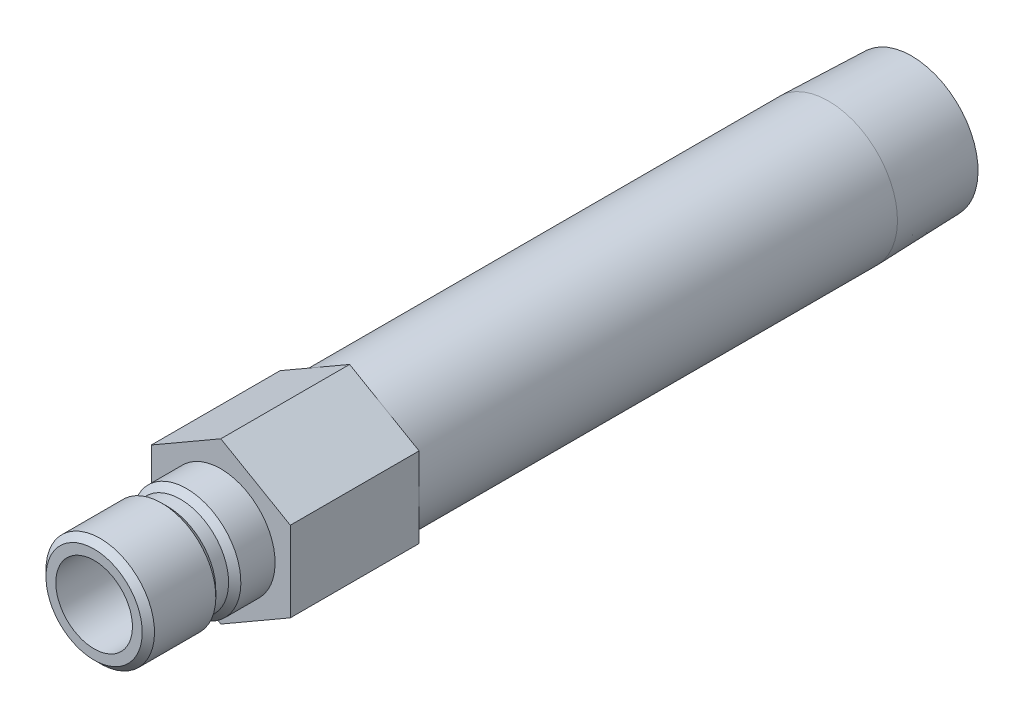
from build123d import *

# Parameters (mm, degrees)
SKETCH2_R           = 4.7625
BOSS_EXTRUDE1_DEPTH = 16.002


with BuildPart() as part:
    # Sketch1 → Revolve1 (revolve)
    with BuildSketch(Plane(origin=(0, 0, 0), x_dir=(0, 0, -1), z_dir=(1, 0, 0))):
        Polygon((-15.748, 4.7625), (-15.748, 5.9817), (-14.986, 6.7437), (-7.366, 6.7437), (-6.604, 5.9817), (-5.0165, 5.9817), (-4.2545, 6.7437), (0, 6.7437), (0, 8.5725), (75.5142, 8.5725), (85.852, 8.249445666), (85.852, 6.2611), (16.002, 6.2611), (16.002, 4.7625), align=None)
    revolve(axis=Axis((0, 0, 0), (0, 0, 1)))

    # Sketch2 → Boss-Extrude1 (add)
    with BuildSketch(Plane.XY):
        Polygon((-8.636, 4.985996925), (-8.636, -4.985996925), (0, -9.971993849), (8.636, -4.985996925), (8.636, 4.985996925), (0, 9.971993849), align=None)
        with Locations(Location((0, 0, 0), (0, 0, 90))):
            Circle(SKETCH2_R, mode=Mode.SUBTRACT)
    extrude(amount=-BOSS_EXTRUDE1_DEPTH)


solid = part.part
